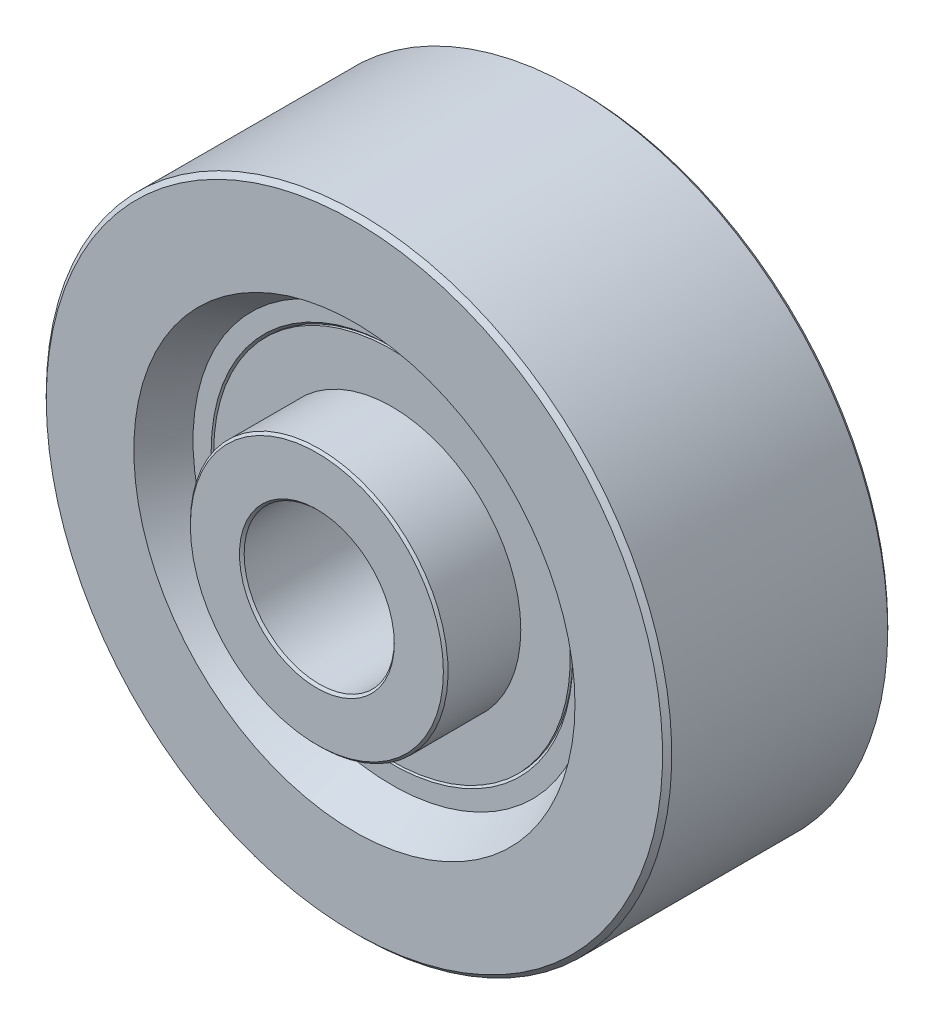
ISO-10303-21;
HEADER;
FILE_DESCRIPTION(('STEP AP214'),'2;1');
FILE_NAME('part.step','',(''),(''),'','','');
FILE_SCHEMA(('AUTOMOTIVE_DESIGN { 1 0 10303 214 1 1 1 1 }'));
ENDSEC;
DATA;
#1=APPLICATION_CONTEXT('core data for automotive mechanical design processes');
#2=APPLICATION_PROTOCOL_DEFINITION('international standard','automotive_design',2000,#1);
#3=PRODUCT_CONTEXT('',#1,'mechanical');
#4=PRODUCT('Part','Part','',(#3));
#5=PRODUCT_RELATED_PRODUCT_CATEGORY('part','',(#4));
#6=PRODUCT_DEFINITION_FORMATION('','',#4);
#7=PRODUCT_DEFINITION_CONTEXT('part definition',#1,'design');
#8=PRODUCT_DEFINITION('design','',#6,#7);
#9=PRODUCT_DEFINITION_SHAPE('','',#8);
#10=(LENGTH_UNIT() NAMED_UNIT(*) SI_UNIT(.MILLI.,.METRE.));
#11=(NAMED_UNIT(*) PLANE_ANGLE_UNIT() SI_UNIT($,.RADIAN.));
#12=(NAMED_UNIT(*) SI_UNIT($,.STERADIAN.) SOLID_ANGLE_UNIT());
#13=UNCERTAINTY_MEASURE_WITH_UNIT(LENGTH_MEASURE(1.E-05),#10,'distance_accuracy_value','');
#14=(GEOMETRIC_REPRESENTATION_CONTEXT(3) GLOBAL_UNCERTAINTY_ASSIGNED_CONTEXT((#13)) GLOBAL_UNIT_ASSIGNED_CONTEXT((#10,
#11,#12)) REPRESENTATION_CONTEXT('',''));
#15=CARTESIAN_POINT('',(0.,0.,0.));
#16=DIRECTION('',(0.,0.,1.));
#17=DIRECTION('',(1.,0.,0.));
#18=AXIS2_PLACEMENT_3D('',#15,#16,#17);
#19=CARTESIAN_POINT('',(0.,0.,0.));
#20=DIRECTION('',(0.,0.,-1.));
#21=DIRECTION('',(-1.,0.,0.));
#22=AXIS2_PLACEMENT_3D('',#19,#20,#21);
#23=CYLINDRICAL_SURFACE('',#22,3.);
#24=CARTESIAN_POINT('',(0.,0.,-5.9063636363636));
#25=DIRECTION('',(0.,0.,-1.));
#26=DIRECTION('',(-1.,0.,0.));
#27=AXIS2_PLACEMENT_3D('',#24,#25,#26);
#28=CIRCLE('',#27,3.);
#29=CARTESIAN_POINT('',(-3.,0.,-5.9063636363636));
#30=VERTEX_POINT('',#29);
#31=EDGE_CURVE('E24',#30,#30,#28,.F.);
#32=ORIENTED_EDGE('',*,*,#31,.F.);
#33=EDGE_LOOP('',(#32));
#34=FACE_BOUND('',#33,.T.);
#35=CARTESIAN_POINT('',(0.,0.,5.90636363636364));
#36=DIRECTION('',(0.,0.,-1.));
#37=DIRECTION('',(-1.,0.,0.));
#38=AXIS2_PLACEMENT_3D('',#35,#36,#37);
#39=CIRCLE('',#38,3.);
#40=CARTESIAN_POINT('',(-3.,0.,5.90636363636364));
#41=VERTEX_POINT('',#40);
#42=EDGE_CURVE('E325',#41,#41,#39,.T.);
#43=ORIENTED_EDGE('',*,*,#42,.F.);
#44=EDGE_LOOP('',(#43));
#45=FACE_BOUND('',#44,.T.);
#46=ADVANCED_FACE('F12',(#34,#45),#23,.F.);
#47=CARTESIAN_POINT('',(0.,0.,-5.99999999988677));
#48=DIRECTION('',(0.,0.,-1.));
#49=DIRECTION('',(-1.,0.,0.));
#50=AXIS2_PLACEMENT_3D('',#47,#48,#49);
#51=CONICAL_SURFACE('',#50,3.0936363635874,0.785398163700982);
#52=CARTESIAN_POINT('',(0.,0.,-5.99999999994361));
#53=DIRECTION('',(0.,0.,-1.));
#54=DIRECTION('',(-1.,0.,0.));
#55=AXIS2_PLACEMENT_3D('',#52,#53,#54);
#56=CIRCLE('',#55,3.09363636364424);
#57=CARTESIAN_POINT('',(-3.09363636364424,0.,-5.99999999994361));
#58=VERTEX_POINT('',#57);
#59=EDGE_CURVE('E326',#58,#58,#56,.F.);
#60=ORIENTED_EDGE('',*,*,#59,.F.);
#61=EDGE_LOOP('',(#60));
#62=FACE_BOUND('',#61,.T.);
#63=ORIENTED_EDGE('',*,*,#31,.T.);
#64=EDGE_LOOP('',(#63));
#65=FACE_BOUND('',#64,.T.);
#66=ADVANCED_FACE('F291',(#62,#65),#51,.F.);
#67=CARTESIAN_POINT('',(0.,4.075,-6.));
#68=DIRECTION('',(0.,0.,-1.));
#69=DIRECTION('',(-1.,0.,0.));
#70=AXIS2_PLACEMENT_3D('',#67,#68,#69);
#71=PLANE('',#70);
#72=ORIENTED_EDGE('',*,*,#59,.T.);
#73=EDGE_LOOP('',(#72));
#74=FACE_BOUND('',#73,.T.);
#75=CARTESIAN_POINT('',(0.,0.,-6.00000000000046));
#76=DIRECTION('',(0.,0.,1.));
#77=DIRECTION('',(1.,0.,0.));
#78=AXIS2_PLACEMENT_3D('',#75,#76,#77);
#79=CIRCLE('',#78,5.05636363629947);
#80=CARTESIAN_POINT('',(5.05636363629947,0.,-6.00000000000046));
#81=VERTEX_POINT('',#80);
#82=EDGE_CURVE('E339',#81,#81,#79,.F.);
#83=ORIENTED_EDGE('',*,*,#82,.T.);
#84=EDGE_LOOP('',(#83));
#85=FACE_BOUND('',#84,.T.);
#86=ADVANCED_FACE('F282',(#74,#85),#71,.T.);
#87=CARTESIAN_POINT('',(0.,0.,-5.90636363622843));
#88=DIRECTION('',(0.,0.,1.));
#89=DIRECTION('',(1.,0.,0.));
#90=AXIS2_PLACEMENT_3D('',#87,#88,#89);
#91=CONICAL_SURFACE('',#90,5.15000000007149,0.785398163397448);
#92=CARTESIAN_POINT('',(0.,0.,-5.90636363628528));
#93=DIRECTION('',(0.,0.,1.));
#94=DIRECTION('',(0.,1.,0.));
#95=AXIS2_PLACEMENT_3D('',#92,#93,#94);
#96=CIRCLE('',#95,5.1499999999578);
#97=CARTESIAN_POINT('',(0.,5.1499999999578,-5.90636363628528));
#98=VERTEX_POINT('',#97);
#99=EDGE_CURVE('E333',#98,#98,#96,.F.);
#100=ORIENTED_EDGE('',*,*,#99,.T.);
#101=EDGE_LOOP('',(#100));
#102=FACE_BOUND('',#101,.T.);
#103=ORIENTED_EDGE('',*,*,#82,.F.);
#104=EDGE_LOOP('',(#103));
#105=FACE_BOUND('',#104,.T.);
#106=ADVANCED_FACE('F273',(#102,#105),#91,.T.);
#107=CARTESIAN_POINT('',(0.,0.,-3.19231585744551));
#108=DIRECTION('',(0.,0.,-1.));
#109=DIRECTION('',(-1.,0.,0.));
#110=AXIS2_PLACEMENT_3D('',#107,#108,#109);
#111=CYLINDRICAL_SURFACE('',#110,5.15);
#112=CARTESIAN_POINT('',(0.,0.,-3.));
#113=DIRECTION('',(0.,0.,-1.));
#114=DIRECTION('',(-1.,0.,0.));
#115=AXIS2_PLACEMENT_3D('',#112,#113,#114);
#116=CIRCLE('',#115,5.15);
#117=CARTESIAN_POINT('',(-5.15,0.,-3.));
#118=VERTEX_POINT('',#117);
#119=EDGE_CURVE('E16',#118,#118,#116,.F.);
#120=ORIENTED_EDGE('',*,*,#119,.F.);
#121=EDGE_LOOP('',(#120));
#122=FACE_BOUND('',#121,.T.);
#123=ORIENTED_EDGE('',*,*,#99,.F.);
#124=EDGE_LOOP('',(#123));
#125=FACE_BOUND('',#124,.T.);
#126=ADVANCED_FACE('F264',(#122,#125),#111,.T.);
#127=CARTESIAN_POINT('',(0.,0.,5.9999999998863));
#128=DIRECTION('',(0.,0.,1.));
#129=DIRECTION('',(1.,0.,0.));
#130=AXIS2_PLACEMENT_3D('',#127,#128,#129);
#131=CONICAL_SURFACE('',#130,3.09363636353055,0.785398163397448);
#132=ORIENTED_EDGE('',*,*,#42,.T.);
#133=EDGE_LOOP('',(#132));
#134=FACE_BOUND('',#133,.T.);
#135=CARTESIAN_POINT('',(0.,0.,5.99999999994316));
#136=DIRECTION('',(0.,0.,1.));
#137=DIRECTION('',(1.,0.,0.));
#138=AXIS2_PLACEMENT_3D('',#135,#136,#137);
#139=CIRCLE('',#138,3.0936363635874);
#140=CARTESIAN_POINT('',(3.0936363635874,0.,5.99999999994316));
#141=VERTEX_POINT('',#140);
#142=EDGE_CURVE('E330',#141,#141,#139,.F.);
#143=ORIENTED_EDGE('',*,*,#142,.F.);
#144=EDGE_LOOP('',(#143));
#145=FACE_BOUND('',#144,.T.);
#146=ADVANCED_FACE('F255',(#134,#145),#131,.F.);
#147=CARTESIAN_POINT('',(0.,4.075,6.));
#148=DIRECTION('',(0.,0.,1.));
#149=DIRECTION('',(1.,0.,0.));
#150=AXIS2_PLACEMENT_3D('',#147,#148,#149);
#151=PLANE('',#150);
#152=CARTESIAN_POINT('',(0.,0.,6.));
#153=DIRECTION('',(0.,0.,-1.));
#154=DIRECTION('',(-1.,0.,0.));
#155=AXIS2_PLACEMENT_3D('',#152,#153,#154);
#156=CIRCLE('',#155,5.05636363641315);
#157=CARTESIAN_POINT('',(-5.05636363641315,0.,6.));
#158=VERTEX_POINT('',#157);
#159=EDGE_CURVE('E27',#158,#158,#156,.F.);
#160=ORIENTED_EDGE('',*,*,#159,.T.);
#161=EDGE_LOOP('',(#160));
#162=FACE_BOUND('',#161,.T.);
#163=ORIENTED_EDGE('',*,*,#142,.T.);
#164=EDGE_LOOP('',(#163));
#165=FACE_BOUND('',#164,.T.);
#166=ADVANCED_FACE('F246',(#162,#165),#151,.T.);
#167=CARTESIAN_POINT('',(0.,0.,5.90636363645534));
#168=DIRECTION('',(0.,0.,-1.));
#169=DIRECTION('',(-1.,0.,0.));
#170=AXIS2_PLACEMENT_3D('',#167,#168,#169);
#171=CONICAL_SURFACE('',#170,5.14999999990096,0.785398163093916);
#172=ORIENTED_EDGE('',*,*,#159,.F.);
#173=EDGE_LOOP('',(#172));
#174=FACE_BOUND('',#173,.T.);
#175=CARTESIAN_POINT('',(0.,0.,5.9063636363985));
#176=DIRECTION('',(0.,0.,-1.));
#177=DIRECTION('',(0.,1.,0.));
#178=AXIS2_PLACEMENT_3D('',#175,#176,#177);
#179=CIRCLE('',#178,5.1499999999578);
#180=CARTESIAN_POINT('',(0.,5.1499999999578,5.9063636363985));
#181=VERTEX_POINT('',#180);
#182=EDGE_CURVE('E47',#181,#181,#179,.F.);
#183=ORIENTED_EDGE('',*,*,#182,.T.);
#184=EDGE_LOOP('',(#183));
#185=FACE_BOUND('',#184,.T.);
#186=ADVANCED_FACE('F239',(#174,#185),#171,.T.);
#187=CARTESIAN_POINT('',(0.,0.,3.19231585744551));
#188=DIRECTION('',(0.,0.,-1.));
#189=DIRECTION('',(-1.,0.,0.));
#190=AXIS2_PLACEMENT_3D('',#187,#188,#189);
#191=CYLINDRICAL_SURFACE('',#190,5.15);
#192=ORIENTED_EDGE('',*,*,#182,.F.);
#193=EDGE_LOOP('',(#192));
#194=FACE_BOUND('',#193,.T.);
#195=CARTESIAN_POINT('',(0.,0.,3.));
#196=DIRECTION('',(0.,0.,1.));
#197=DIRECTION('',(1.,0.,0.));
#198=AXIS2_PLACEMENT_3D('',#195,#196,#197);
#199=CIRCLE('',#198,5.15);
#200=CARTESIAN_POINT('',(5.15,0.,3.));
#201=VERTEX_POINT('',#200);
#202=EDGE_CURVE('E8',#201,#201,#199,.F.);
#203=ORIENTED_EDGE('',*,*,#202,.F.);
#204=EDGE_LOOP('',(#203));
#205=FACE_BOUND('',#204,.T.);
#206=ADVANCED_FACE('F116',(#194,#205),#191,.T.);
#207=CARTESIAN_POINT('',(0.,0.,0.));
#208=DIRECTION('',(0.,0.,-1.));
#209=DIRECTION('',(-1.,0.,0.));
#210=AXIS2_PLACEMENT_3D('',#207,#208,#209);
#211=CYLINDRICAL_SURFACE('',#210,12.5);
#212=CARTESIAN_POINT('',(0.,0.,4.31617647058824));
#213=DIRECTION('',(0.,0.,-1.));
#214=DIRECTION('',(-1.,0.,0.));
#215=AXIS2_PLACEMENT_3D('',#212,#213,#214);
#216=CIRCLE('',#215,12.5);
#217=CARTESIAN_POINT('',(-12.5,0.,4.31617647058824));
#218=VERTEX_POINT('',#217);
#219=EDGE_CURVE('E34',#218,#218,#216,.T.);
#220=ORIENTED_EDGE('',*,*,#219,.T.);
#221=EDGE_LOOP('',(#220));
#222=FACE_BOUND('',#221,.T.);
#223=CARTESIAN_POINT('',(0.,0.,-4.3161764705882));
#224=DIRECTION('',(0.,0.,-1.));
#225=DIRECTION('',(-1.,0.,0.));
#226=AXIS2_PLACEMENT_3D('',#223,#224,#225);
#227=CIRCLE('',#226,12.5);
#228=CARTESIAN_POINT('',(-12.5,0.,-4.3161764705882));
#229=VERTEX_POINT('',#228);
#230=EDGE_CURVE('E33',#229,#229,#227,.F.);
#231=ORIENTED_EDGE('',*,*,#230,.T.);
#232=EDGE_LOOP('',(#231));
#233=FACE_BOUND('',#232,.T.);
#234=ADVANCED_FACE('F86',(#222,#233),#211,.T.);
#235=CARTESIAN_POINT('',(0.,0.,-4.3161764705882));
#236=DIRECTION('',(0.,0.,1.));
#237=DIRECTION('',(1.,0.,0.));
#238=AXIS2_PLACEMENT_3D('',#235,#236,#237);
#239=CONICAL_SURFACE('',#238,12.5,0.785398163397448);
#240=CARTESIAN_POINT('',(0.,0.,-4.5));
#241=DIRECTION('',(0.,0.,1.));
#242=DIRECTION('',(1.,0.,0.));
#243=AXIS2_PLACEMENT_3D('',#240,#241,#242);
#244=CIRCLE('',#243,12.3161764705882);
#245=CARTESIAN_POINT('',(12.3161764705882,0.,-4.5));
#246=VERTEX_POINT('',#245);
#247=EDGE_CURVE('E37',#246,#246,#244,.T.);
#248=ORIENTED_EDGE('',*,*,#247,.T.);
#249=EDGE_LOOP('',(#248));
#250=FACE_BOUND('',#249,.T.);
#251=ORIENTED_EDGE('',*,*,#230,.F.);
#252=EDGE_LOOP('',(#251));
#253=FACE_BOUND('',#252,.T.);
#254=ADVANCED_FACE('F115',(#250,#253),#239,.T.);
#255=CARTESIAN_POINT('',(0.,10.5661009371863,-4.5));
#256=DIRECTION('',(0.,0.,-1.));
#257=DIRECTION('',(-1.,0.,0.));
#258=AXIS2_PLACEMENT_3D('',#255,#256,#257);
#259=PLANE('',#258);
#260=CARTESIAN_POINT('',(0.,0.,-4.5));
#261=DIRECTION('',(0.,0.,-1.));
#262=DIRECTION('',(-1.,0.,0.));
#263=AXIS2_PLACEMENT_3D('',#260,#261,#262);
#264=CIRCLE('',#263,8.81602540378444);
#265=CARTESIAN_POINT('',(-8.81602540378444,0.,-4.5));
#266=VERTEX_POINT('',#265);
#267=EDGE_CURVE('E53',#266,#266,#264,.F.);
#268=ORIENTED_EDGE('',*,*,#267,.T.);
#269=EDGE_LOOP('',(#268));
#270=FACE_BOUND('',#269,.T.);
#271=ORIENTED_EDGE('',*,*,#247,.F.);
#272=EDGE_LOOP('',(#271));
#273=FACE_BOUND('',#272,.T.);
#274=ADVANCED_FACE('F119',(#270,#273),#259,.T.);
#275=CARTESIAN_POINT('',(0.,0.,-4.5));
#276=DIRECTION('',(0.,0.,-1.));
#277=DIRECTION('',(-1.,0.,0.));
#278=AXIS2_PLACEMENT_3D('',#275,#276,#277);
#279=CONICAL_SURFACE('',#278,8.81602540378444,0.523598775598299);
#280=ORIENTED_EDGE('',*,*,#267,.F.);
#281=EDGE_LOOP('',(#280));
#282=FACE_BOUND('',#281,.T.);
#283=CARTESIAN_POINT('',(0.,0.,-3.));
#284=DIRECTION('',(0.,0.,-1.));
#285=DIRECTION('',(-1.,0.,0.));
#286=AXIS2_PLACEMENT_3D('',#283,#284,#285);
#287=CIRCLE('',#286,7.95);
#288=CARTESIAN_POINT('',(-7.95,0.,-3.));
#289=VERTEX_POINT('',#288);
#290=EDGE_CURVE('E59',#289,#289,#287,.T.);
#291=ORIENTED_EDGE('',*,*,#290,.F.);
#292=EDGE_LOOP('',(#291));
#293=FACE_BOUND('',#292,.T.);
#294=ADVANCED_FACE('F123',(#282,#293),#279,.F.);
#295=CARTESIAN_POINT('',(0.,7.5875,-3.));
#296=DIRECTION('',(0.,0.,-1.));
#297=DIRECTION('',(-1.,0.,0.));
#298=AXIS2_PLACEMENT_3D('',#295,#296,#297);
#299=PLANE('',#298);
#300=CARTESIAN_POINT('',(0.,0.,-3.));
#301=DIRECTION('',(0.,0.,-1.));
#302=DIRECTION('',(-1.,0.,0.));
#303=AXIS2_PLACEMENT_3D('',#300,#301,#302);
#304=CIRCLE('',#303,7.225);
#305=CARTESIAN_POINT('',(-7.225,0.,-3.));
#306=VERTEX_POINT('',#305);
#307=EDGE_CURVE('E65',#306,#306,#304,.F.);
#308=ORIENTED_EDGE('',*,*,#307,.T.);
#309=EDGE_LOOP('',(#308));
#310=FACE_BOUND('',#309,.T.);
#311=ORIENTED_EDGE('',*,*,#290,.T.);
#312=EDGE_LOOP('',(#311));
#313=FACE_BOUND('',#312,.T.);
#314=ADVANCED_FACE('F128',(#310,#313),#299,.T.);
#315=CARTESIAN_POINT('',(0.,0.,-3.));
#316=DIRECTION('',(0.,0.,-1.));
#317=DIRECTION('',(-1.,0.,0.));
#318=AXIS2_PLACEMENT_3D('',#315,#316,#317);
#319=CONICAL_SURFACE('',#318,7.225,0.785398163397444);
#320=ORIENTED_EDGE('',*,*,#307,.F.);
#321=EDGE_LOOP('',(#320));
#322=FACE_BOUND('',#321,.T.);
#323=CARTESIAN_POINT('',(0.,0.,-2.9));
#324=DIRECTION('',(0.,0.,-1.));
#325=DIRECTION('',(0.,1.,0.));
#326=AXIS2_PLACEMENT_3D('',#323,#324,#325);
#327=CIRCLE('',#326,7.125);
#328=CARTESIAN_POINT('',(0.,7.125,-2.9));
#329=VERTEX_POINT('',#328);
#330=EDGE_CURVE('E40',#329,#329,#327,.T.);
#331=ORIENTED_EDGE('',*,*,#330,.F.);
#332=EDGE_LOOP('',(#331));
#333=FACE_BOUND('',#332,.T.);
#334=ADVANCED_FACE('F87',(#322,#333),#319,.F.);
#335=CARTESIAN_POINT('',(0.,0.,-2.625));
#336=DIRECTION('',(0.,0.,-1.));
#337=DIRECTION('',(-1.,0.,0.));
#338=AXIS2_PLACEMENT_3D('',#335,#336,#337);
#339=CYLINDRICAL_SURFACE('',#338,7.125);
#340=ORIENTED_EDGE('',*,*,#330,.T.);
#341=EDGE_LOOP('',(#340));
#342=FACE_BOUND('',#341,.T.);
#343=CARTESIAN_POINT('',(0.,0.,-3.));
#344=DIRECTION('',(0.,0.,-1.));
#345=DIRECTION('',(-1.,0.,0.));
#346=AXIS2_PLACEMENT_3D('',#343,#344,#345);
#347=CIRCLE('',#346,7.125);
#348=CARTESIAN_POINT('',(-7.125,0.,-3.));
#349=VERTEX_POINT('',#348);
#350=EDGE_CURVE('E44',#349,#349,#347,.F.);
#351=ORIENTED_EDGE('',*,*,#350,.T.);
#352=EDGE_LOOP('',(#351));
#353=FACE_BOUND('',#352,.T.);
#354=ADVANCED_FACE('F72',(#342,#353),#339,.T.);
#355=CARTESIAN_POINT('',(0.,6.1375,-3.));
#356=DIRECTION('',(0.,0.,-1.));
#357=DIRECTION('',(-1.,0.,0.));
#358=AXIS2_PLACEMENT_3D('',#355,#356,#357);
#359=PLANE('',#358);
#360=ORIENTED_EDGE('',*,*,#119,.T.);
#361=EDGE_LOOP('',(#360));
#362=FACE_BOUND('',#361,.T.);
#363=ORIENTED_EDGE('',*,*,#350,.F.);
#364=EDGE_LOOP('',(#363));
#365=FACE_BOUND('',#364,.T.);
#366=ADVANCED_FACE('F14',(#362,#365),#359,.T.);
#367=CARTESIAN_POINT('',(0.,0.,4.31617647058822));
#368=DIRECTION('',(0.,0.,-1.));
#369=DIRECTION('',(-1.,0.,0.));
#370=AXIS2_PLACEMENT_3D('',#367,#368,#369);
#371=CONICAL_SURFACE('',#370,12.5,0.785398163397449);
#372=CARTESIAN_POINT('',(0.,0.,4.5));
#373=DIRECTION('',(0.,0.,-1.));
#374=DIRECTION('',(-1.,0.,0.));
#375=AXIS2_PLACEMENT_3D('',#372,#373,#374);
#376=CIRCLE('',#375,12.3161764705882);
#377=CARTESIAN_POINT('',(-12.3161764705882,0.,4.5));
#378=VERTEX_POINT('',#377);
#379=EDGE_CURVE('E50',#378,#378,#376,.T.);
#380=ORIENTED_EDGE('',*,*,#379,.T.);
#381=EDGE_LOOP('',(#380));
#382=FACE_BOUND('',#381,.T.);
#383=ORIENTED_EDGE('',*,*,#219,.F.);
#384=EDGE_LOOP('',(#383));
#385=FACE_BOUND('',#384,.T.);
#386=ADVANCED_FACE('F75',(#382,#385),#371,.T.);
#387=CARTESIAN_POINT('',(0.,10.5661009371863,4.5));
#388=DIRECTION('',(0.,0.,1.));
#389=DIRECTION('',(1.,0.,0.));
#390=AXIS2_PLACEMENT_3D('',#387,#388,#389);
#391=PLANE('',#390);
#392=ORIENTED_EDGE('',*,*,#379,.F.);
#393=EDGE_LOOP('',(#392));
#394=FACE_BOUND('',#393,.T.);
#395=CARTESIAN_POINT('',(0.,0.,4.5));
#396=DIRECTION('',(0.,0.,1.));
#397=DIRECTION('',(1.,0.,0.));
#398=AXIS2_PLACEMENT_3D('',#395,#396,#397);
#399=CIRCLE('',#398,8.81602540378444);
#400=CARTESIAN_POINT('',(8.81602540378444,0.,4.5));
#401=VERTEX_POINT('',#400);
#402=EDGE_CURVE('E56',#401,#401,#399,.F.);
#403=ORIENTED_EDGE('',*,*,#402,.T.);
#404=EDGE_LOOP('',(#403));
#405=FACE_BOUND('',#404,.T.);
#406=ADVANCED_FACE('F77',(#394,#405),#391,.T.);
#407=CARTESIAN_POINT('',(0.,0.,4.5));
#408=DIRECTION('',(0.,0.,1.));
#409=DIRECTION('',(1.,0.,0.));
#410=AXIS2_PLACEMENT_3D('',#407,#408,#409);
#411=CONICAL_SURFACE('',#410,8.81602540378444,0.523598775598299);
#412=CARTESIAN_POINT('',(0.,0.,3.));
#413=DIRECTION('',(0.,0.,1.));
#414=DIRECTION('',(1.,0.,0.));
#415=AXIS2_PLACEMENT_3D('',#412,#413,#414);
#416=CIRCLE('',#415,7.95);
#417=CARTESIAN_POINT('',(7.95,0.,3.));
#418=VERTEX_POINT('',#417);
#419=EDGE_CURVE('E62',#418,#418,#416,.T.);
#420=ORIENTED_EDGE('',*,*,#419,.F.);
#421=EDGE_LOOP('',(#420));
#422=FACE_BOUND('',#421,.T.);
#423=ORIENTED_EDGE('',*,*,#402,.F.);
#424=EDGE_LOOP('',(#423));
#425=FACE_BOUND('',#424,.T.);
#426=ADVANCED_FACE('F91',(#422,#425),#411,.F.);
#427=CARTESIAN_POINT('',(0.,7.5875,3.));
#428=DIRECTION('',(0.,0.,1.));
#429=DIRECTION('',(1.,0.,0.));
#430=AXIS2_PLACEMENT_3D('',#427,#428,#429);
#431=PLANE('',#430);
#432=ORIENTED_EDGE('',*,*,#419,.T.);
#433=EDGE_LOOP('',(#432));
#434=FACE_BOUND('',#433,.T.);
#435=CARTESIAN_POINT('',(0.,0.,3.));
#436=DIRECTION('',(0.,0.,1.));
#437=DIRECTION('',(1.,0.,0.));
#438=AXIS2_PLACEMENT_3D('',#435,#436,#437);
#439=CIRCLE('',#438,7.225);
#440=CARTESIAN_POINT('',(7.225,0.,3.));
#441=VERTEX_POINT('',#440);
#442=EDGE_CURVE('E43',#441,#441,#439,.F.);
#443=ORIENTED_EDGE('',*,*,#442,.T.);
#444=EDGE_LOOP('',(#443));
#445=FACE_BOUND('',#444,.T.);
#446=ADVANCED_FACE('F106',(#434,#445),#431,.T.);
#447=CARTESIAN_POINT('',(0.,0.,3.));
#448=DIRECTION('',(0.,0.,1.));
#449=DIRECTION('',(1.,0.,0.));
#450=AXIS2_PLACEMENT_3D('',#447,#448,#449);
#451=CONICAL_SURFACE('',#450,7.225,0.785398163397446);
#452=CARTESIAN_POINT('',(0.,0.,2.9));
#453=DIRECTION('',(0.,0.,1.));
#454=DIRECTION('',(0.,1.,0.));
#455=AXIS2_PLACEMENT_3D('',#452,#453,#454);
#456=CIRCLE('',#455,7.125);
#457=CARTESIAN_POINT('',(0.,7.125,2.9));
#458=VERTEX_POINT('',#457);
#459=EDGE_CURVE('E32',#458,#458,#456,.T.);
#460=ORIENTED_EDGE('',*,*,#459,.F.);
#461=EDGE_LOOP('',(#460));
#462=FACE_BOUND('',#461,.T.);
#463=ORIENTED_EDGE('',*,*,#442,.F.);
#464=EDGE_LOOP('',(#463));
#465=FACE_BOUND('',#464,.T.);
#466=ADVANCED_FACE('F96',(#462,#465),#451,.F.);
#467=CARTESIAN_POINT('',(0.,0.,2.625));
#468=DIRECTION('',(0.,0.,-1.));
#469=DIRECTION('',(-1.,0.,0.));
#470=AXIS2_PLACEMENT_3D('',#467,#468,#469);
#471=CYLINDRICAL_SURFACE('',#470,7.125);
#472=CARTESIAN_POINT('',(0.,0.,3.));
#473=DIRECTION('',(0.,0.,-1.));
#474=DIRECTION('',(-1.,0.,0.));
#475=AXIS2_PLACEMENT_3D('',#472,#473,#474);
#476=CIRCLE('',#475,7.125);
#477=CARTESIAN_POINT('',(-7.125,0.,3.));
#478=VERTEX_POINT('',#477);
#479=EDGE_CURVE('E29',#478,#478,#476,.F.);
#480=ORIENTED_EDGE('',*,*,#479,.F.);
#481=EDGE_LOOP('',(#480));
#482=FACE_BOUND('',#481,.T.);
#483=ORIENTED_EDGE('',*,*,#459,.T.);
#484=EDGE_LOOP('',(#483));
#485=FACE_BOUND('',#484,.T.);
#486=ADVANCED_FACE('F94',(#482,#485),#471,.T.);
#487=CARTESIAN_POINT('',(0.,6.1375,3.));
#488=DIRECTION('',(0.,0.,1.));
#489=DIRECTION('',(1.,0.,0.));
#490=AXIS2_PLACEMENT_3D('',#487,#488,#489);
#491=PLANE('',#490);
#492=ORIENTED_EDGE('',*,*,#479,.T.);
#493=EDGE_LOOP('',(#492));
#494=FACE_BOUND('',#493,.T.);
#495=ORIENTED_EDGE('',*,*,#202,.T.);
#496=EDGE_LOOP('',(#495));
#497=FACE_BOUND('',#496,.T.);
#498=ADVANCED_FACE('F89',(#494,#497),#491,.T.);
#499=CLOSED_SHELL('',(#46,#66,#86,#106,#126,#146,#166,#186,#206,#234,#254,#274,#294,#314,#334,
#354,#366,#386,#406,#426,#446,#466,#486,#498));
#500=MANIFOLD_SOLID_BREP('B1',#499);
#501=ADVANCED_BREP_SHAPE_REPRESENTATION('',(#18,#500),#14);
#502=SHAPE_DEFINITION_REPRESENTATION(#9,#501);
ENDSEC;
END-ISO-10303-21;
